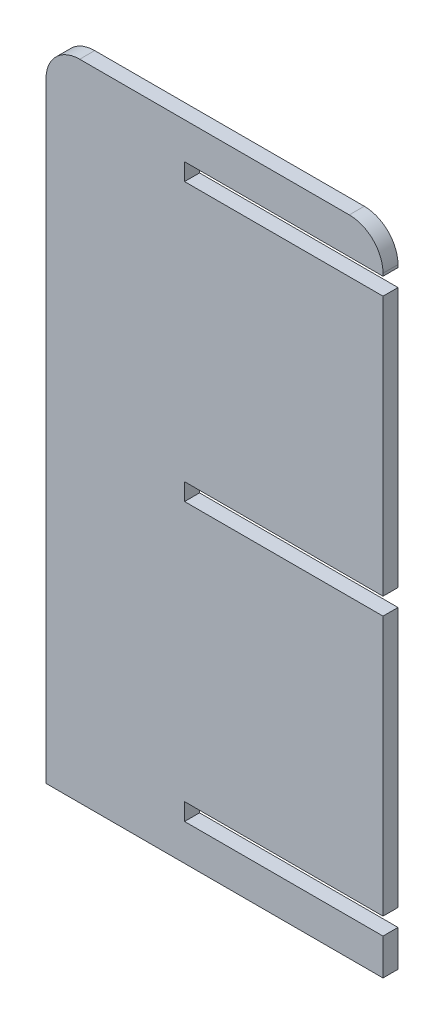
from build123d import *

# Parameters (mm, degrees)
SALIENTE_EXTRUIR1_DEPTH = 20


with BuildPart() as part:
    # Croquis1 → Saliente-Extruir1 (new body)
    with BuildSketch(Plane.XY):
        with BuildLine():
            Line((-222.670481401, -649.792443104), (227.329518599, -649.792443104))
            Line((227.329518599, -649.792443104), (227.329518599, -601.292443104))
            Line((227.329518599, -601.292443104), (-37.670481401, -601.292443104))
            Line((-37.670481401, -601.292443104), (-37.670481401, -578.292443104))
            Line((-37.670481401, -578.292443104), (227.329518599, -578.292443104))
            Line((227.329518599, -578.292443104), (227.329518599, -231.292443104))
            Line((227.329518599, -231.292443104), (-37.670481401, -231.292443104))
            Line((-37.670481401, -231.292443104), (-37.670481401, -208.292443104))
            Line((-37.670481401, -208.292443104), (227.329518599, -208.292443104))
            Line((227.329518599, -208.292443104), (227.329518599, 138.707556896))
            Line((227.329518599, 138.707556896), (-37.670481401, 138.707556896))
            Line((-37.670481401, 138.707556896), (-37.670481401, 161.707556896))
            Line((-37.670481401, 161.707556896), (227.329518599, 161.707556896))
            Line((227.329518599, 161.707556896), (227.329518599, 165.207556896))
            ThreePointArc((227.329518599, 165.207556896), (214.149323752, 197.02736205), (182.329518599, 210.207556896))
            Line((182.329518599, 210.207556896), (-177.670481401, 210.207556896))
            ThreePointArc((-177.670481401, 210.207556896), (-209.490286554, 197.02736205), (-222.670481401, 165.207556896))
            Line((-222.670481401, 165.207556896), (-222.670481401, -649.792443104))
        make_face()
    extrude(amount=SALIENTE_EXTRUIR1_DEPTH)


solid = part.part
